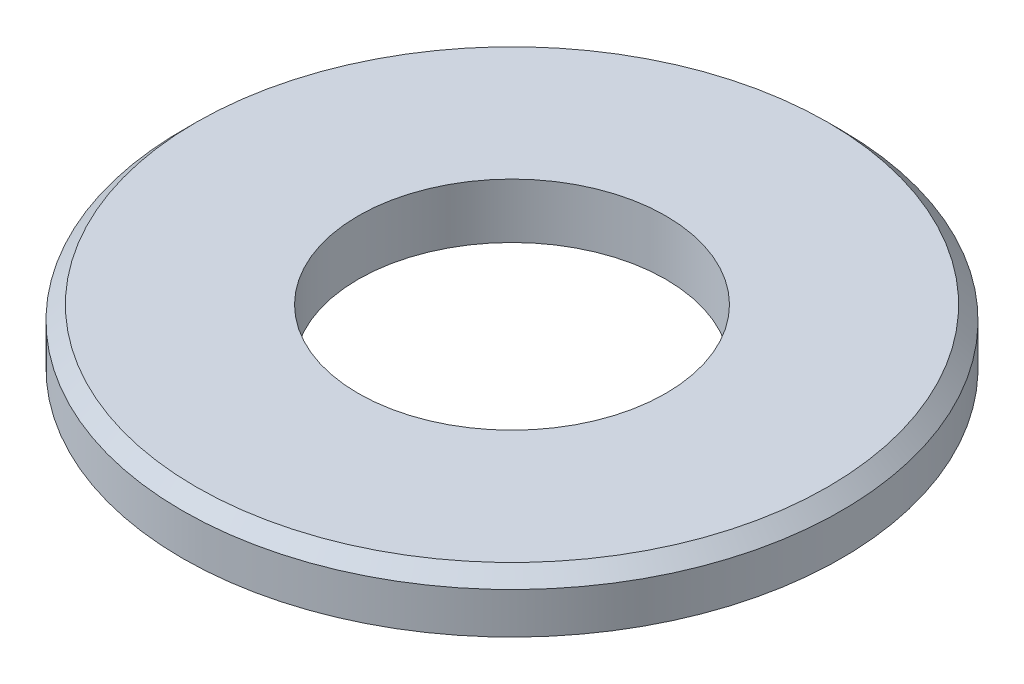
from build123d import *

# Parameters (mm, degrees)
ESQUISSE1_R          = 9
ESQUISSE1_R_2        = 4.2
BASE_EXTRUSION_DEPTH = 1.5
CHANFREIN3_SIZE      = 0.375


with BuildPart() as part:
    # Esquisse1 → Base-Extrusion (new body)
    with BuildSketch(Plane(origin=(0, 0, 0), x_dir=(1, 0, 0), z_dir=(0, 1, 0))):
        with Locations(Location((0, 0, 0), (0, 0, 270))):
            Circle(ESQUISSE1_R)
        with Locations(Location((0, 0, 0), (0, 0, 270))):
            Circle(ESQUISSE1_R_2, mode=Mode.SUBTRACT)
    extrude(amount=BASE_EXTRUSION_DEPTH)

    # Chanfrein3
    chanfrein3_edges = [part.edges().sort_by_distance(p)[0] for p in [
        (0, 1.5, -9),
    ]]
    chamfer(chanfrein3_edges, length=CHANFREIN3_SIZE)


solid = part.part
